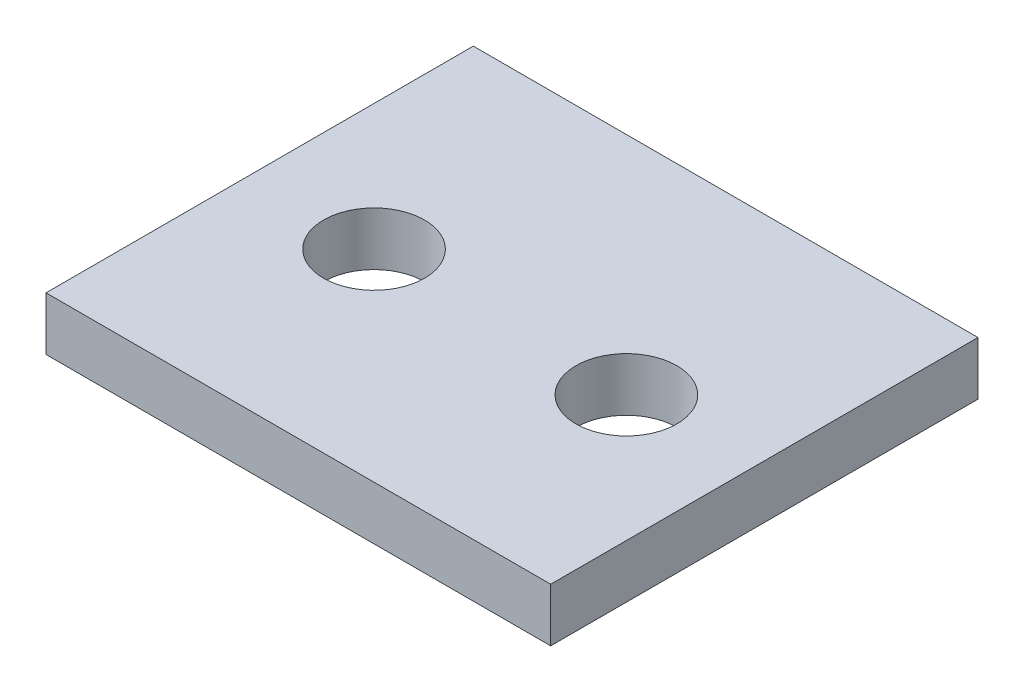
from build123d import *

# Parameters (mm, degrees)
SKETCH1_W      = 30
SKETCH1_H      = 25.4
SKETCH1_R      = 3
EXTRUDE1_DEPTH = 3.175


with BuildPart() as part:
    # Sketch1 → Extrude1 (new body)
    with BuildSketch(Plane(origin=(0, 0, 0), x_dir=(1, 0, 0), z_dir=(0, 1, 0))):
        Rectangle(SKETCH1_W, SKETCH1_H)
        with Locations(Location((-7.5, -0.7, 0), (0, 0, 270))):
            Circle(SKETCH1_R, mode=Mode.SUBTRACT)
        with Locations(Location((7.5, -0.7, 0), (0, 0, 90))):
            Circle(SKETCH1_R, mode=Mode.SUBTRACT)
    extrude(amount=EXTRUDE1_DEPTH)


solid = part.part
